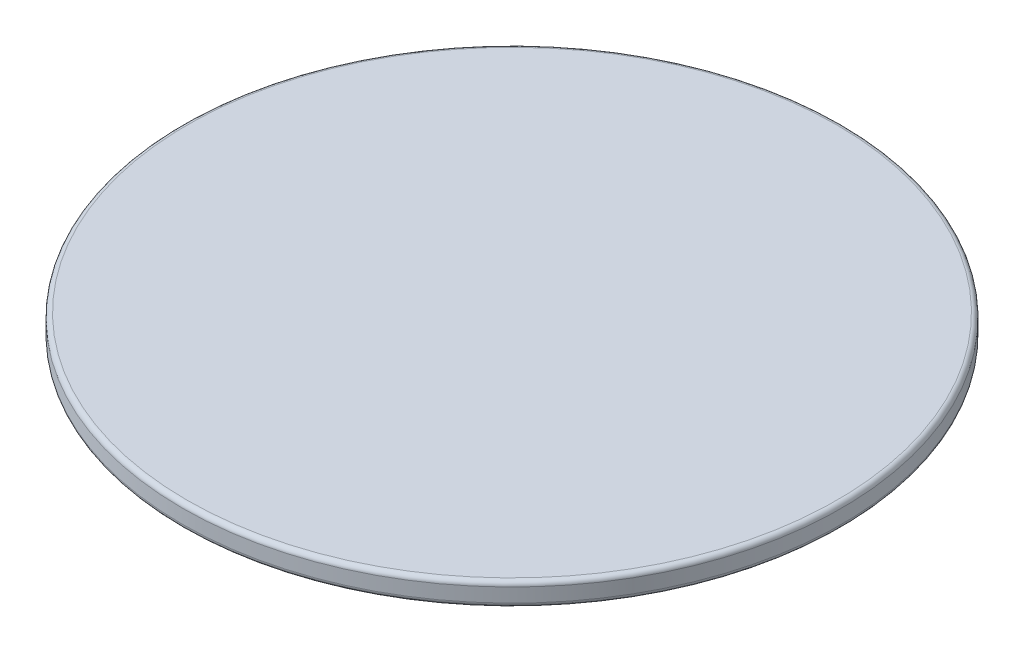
from build123d import *

# Parameters (mm, degrees)
FILLET1_R = 1.27


with BuildPart() as part:
    # Sketch1 → Revolve1 (revolve)
    with BuildSketch(Plane.XY, mode=Mode.PRIVATE) as revolve1_sk:
        Polygon((-59.944, 3.81), (-63.754, 3.81), (-63.754, 0), (0, 0), (0, 19.05), (-90.2335, 19.05), (-90.2335, 12.7), (-63.754, 12.7), (-63.754, 7.62), (-59.944, 7.62), align=None)
    revolve(revolve1_sk.sketch.rotate(Axis((0, 0, 0), (0, 1, 0)), 270), axis=Axis((0, 0, 0), (0, 1, 0)))

    # Fillet1
    fillet1_edges = [part.edges().sort_by_distance(p)[0] for p in [
        (0, 12.7, 90.2335),
        (0, 19.05, 90.2335),
        (0, 0, 63.754),
    ]]
    fillet(fillet1_edges, radius=FILLET1_R)


solid = part.part
